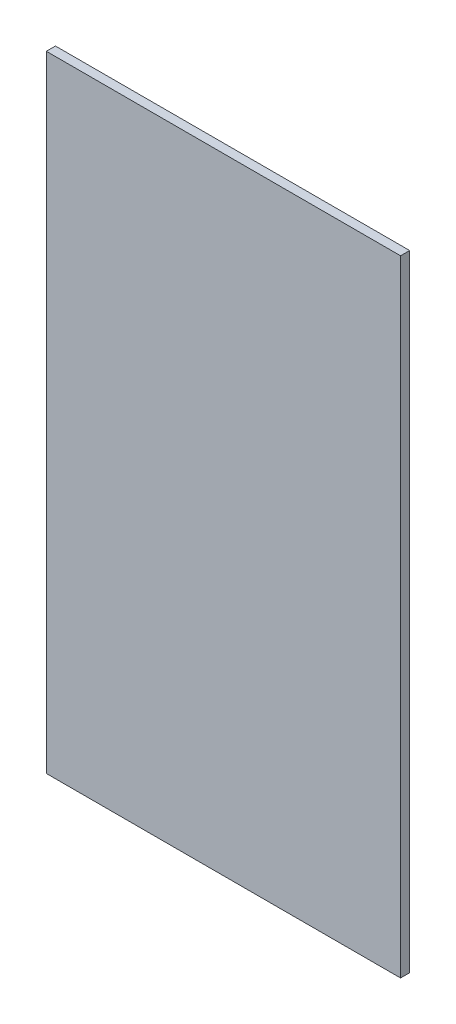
ISO-10303-21;
HEADER;
FILE_DESCRIPTION(('STEP AP214'),'2;1');
FILE_NAME('part.step','',(''),(''),'','','');
FILE_SCHEMA(('AUTOMOTIVE_DESIGN { 1 0 10303 214 1 1 1 1 }'));
ENDSEC;
DATA;
#1=APPLICATION_CONTEXT('core data for automotive mechanical design processes');
#2=APPLICATION_PROTOCOL_DEFINITION('international standard','automotive_design',2000,#1);
#3=PRODUCT_CONTEXT('',#1,'mechanical');
#4=PRODUCT('Part','Part','',(#3));
#5=PRODUCT_RELATED_PRODUCT_CATEGORY('part','',(#4));
#6=PRODUCT_DEFINITION_FORMATION('','',#4);
#7=PRODUCT_DEFINITION_CONTEXT('part definition',#1,'design');
#8=PRODUCT_DEFINITION('design','',#6,#7);
#9=PRODUCT_DEFINITION_SHAPE('','',#8);
#10=(LENGTH_UNIT() NAMED_UNIT(*) SI_UNIT(.MILLI.,.METRE.));
#11=(NAMED_UNIT(*) PLANE_ANGLE_UNIT() SI_UNIT($,.RADIAN.));
#12=(NAMED_UNIT(*) SI_UNIT($,.STERADIAN.) SOLID_ANGLE_UNIT());
#13=UNCERTAINTY_MEASURE_WITH_UNIT(LENGTH_MEASURE(1.E-05),#10,'distance_accuracy_value','');
#14=(GEOMETRIC_REPRESENTATION_CONTEXT(3) GLOBAL_UNCERTAINTY_ASSIGNED_CONTEXT((#13)) GLOBAL_UNIT_ASSIGNED_CONTEXT((#10,
#11,#12)) REPRESENTATION_CONTEXT('',''));
#15=CARTESIAN_POINT('',(0.,0.,0.));
#16=DIRECTION('',(0.,0.,1.));
#17=DIRECTION('',(1.,0.,0.));
#18=AXIS2_PLACEMENT_3D('',#15,#16,#17);
#19=CARTESIAN_POINT('',(350.,618.,18.));
#20=DIRECTION('',(-1.,0.,0.));
#21=DIRECTION('',(0.,-1.,0.));
#22=AXIS2_PLACEMENT_3D('',#19,#20,#21);
#23=PLANE('',#22);
#24=DIRECTION('',(0.,1.,0.));
#25=VECTOR('',#24,1.);
#26=CARTESIAN_POINT('',(350.,618.,0.));
#27=LINE('',#26,#25);
#28=CARTESIAN_POINT('',(350.,-618.,0.));
#29=VERTEX_POINT('',#28);
#30=CARTESIAN_POINT('',(350.,618.,0.));
#31=VERTEX_POINT('',#30);
#32=EDGE_CURVE('E95',#29,#31,#27,.T.);
#33=ORIENTED_EDGE('',*,*,#32,.T.);
#34=DIRECTION('',(0.,0.,-1.));
#35=VECTOR('',#34,1.);
#36=CARTESIAN_POINT('',(350.,618.,18.));
#37=LINE('',#36,#35);
#38=CARTESIAN_POINT('',(350.,618.,18.));
#39=VERTEX_POINT('',#38);
#40=EDGE_CURVE('E11',#39,#31,#37,.T.);
#41=ORIENTED_EDGE('',*,*,#40,.F.);
#42=DIRECTION('',(0.,1.,0.));
#43=VECTOR('',#42,1.);
#44=CARTESIAN_POINT('',(350.,618.,18.));
#45=LINE('',#44,#43);
#46=CARTESIAN_POINT('',(350.,-618.,18.));
#47=VERTEX_POINT('',#46);
#48=EDGE_CURVE('E83',#47,#39,#45,.T.);
#49=ORIENTED_EDGE('',*,*,#48,.F.);
#50=DIRECTION('',(0.,0.,-1.));
#51=VECTOR('',#50,1.);
#52=CARTESIAN_POINT('',(350.,-618.,18.));
#53=LINE('',#52,#51);
#54=EDGE_CURVE('E91',#47,#29,#53,.T.);
#55=ORIENTED_EDGE('',*,*,#54,.T.);
#56=EDGE_LOOP('',(#33,#41,#49,#55));
#57=FACE_BOUND('',#56,.T.);
#58=ADVANCED_FACE('F32',(#57),#23,.F.);
#59=CARTESIAN_POINT('',(-350.,618.,18.));
#60=DIRECTION('',(0.,-1.,0.));
#61=DIRECTION('',(0.,0.,-1.));
#62=AXIS2_PLACEMENT_3D('',#59,#60,#61);
#63=PLANE('',#62);
#64=DIRECTION('',(-1.,0.,0.));
#65=VECTOR('',#64,1.);
#66=CARTESIAN_POINT('',(-350.,618.,0.));
#67=LINE('',#66,#65);
#68=CARTESIAN_POINT('',(-350.,618.,0.));
#69=VERTEX_POINT('',#68);
#70=EDGE_CURVE('E87',#31,#69,#67,.T.);
#71=ORIENTED_EDGE('',*,*,#70,.T.);
#72=DIRECTION('',(0.,0.,-1.));
#73=VECTOR('',#72,1.);
#74=CARTESIAN_POINT('',(-350.,618.,18.));
#75=LINE('',#74,#73);
#76=CARTESIAN_POINT('',(-350.,618.,18.));
#77=VERTEX_POINT('',#76);
#78=EDGE_CURVE('E40',#77,#69,#75,.T.);
#79=ORIENTED_EDGE('',*,*,#78,.F.);
#80=DIRECTION('',(-1.,0.,0.));
#81=VECTOR('',#80,1.);
#82=CARTESIAN_POINT('',(-350.,618.,18.));
#83=LINE('',#82,#81);
#84=EDGE_CURVE('E78',#39,#77,#83,.T.);
#85=ORIENTED_EDGE('',*,*,#84,.F.);
#86=ORIENTED_EDGE('',*,*,#40,.T.);
#87=EDGE_LOOP('',(#71,#79,#85,#86));
#88=FACE_BOUND('',#87,.T.);
#89=ADVANCED_FACE('F86',(#88),#63,.F.);
#90=CARTESIAN_POINT('',(-350.,618.,18.));
#91=DIRECTION('',(1.,0.,0.));
#92=DIRECTION('',(0.,1.,0.));
#93=AXIS2_PLACEMENT_3D('',#90,#91,#92);
#94=PLANE('',#93);
#95=DIRECTION('',(0.,-1.,0.));
#96=VECTOR('',#95,1.);
#97=CARTESIAN_POINT('',(-350.,618.,0.));
#98=LINE('',#97,#96);
#99=CARTESIAN_POINT('',(-350.,-618.,0.));
#100=VERTEX_POINT('',#99);
#101=EDGE_CURVE('E65',#69,#100,#98,.T.);
#102=ORIENTED_EDGE('',*,*,#101,.T.);
#103=DIRECTION('',(0.,0.,-1.));
#104=VECTOR('',#103,1.);
#105=CARTESIAN_POINT('',(-350.,-618.,18.));
#106=LINE('',#105,#104);
#107=CARTESIAN_POINT('',(-350.,-618.,18.));
#108=VERTEX_POINT('',#107);
#109=EDGE_CURVE('E88',#108,#100,#106,.T.);
#110=ORIENTED_EDGE('',*,*,#109,.F.);
#111=DIRECTION('',(0.,-1.,0.));
#112=VECTOR('',#111,1.);
#113=CARTESIAN_POINT('',(-350.,618.,18.));
#114=LINE('',#113,#112);
#115=EDGE_CURVE('E81',#77,#108,#114,.T.);
#116=ORIENTED_EDGE('',*,*,#115,.F.);
#117=ORIENTED_EDGE('',*,*,#78,.T.);
#118=EDGE_LOOP('',(#102,#110,#116,#117));
#119=FACE_BOUND('',#118,.T.);
#120=ADVANCED_FACE('F89',(#119),#94,.F.);
#121=CARTESIAN_POINT('',(-350.,-618.,18.));
#122=DIRECTION('',(0.,1.,0.));
#123=DIRECTION('',(0.,0.,1.));
#124=AXIS2_PLACEMENT_3D('',#121,#122,#123);
#125=PLANE('',#124);
#126=DIRECTION('',(1.,0.,0.));
#127=VECTOR('',#126,1.);
#128=CARTESIAN_POINT('',(-350.,-618.,0.));
#129=LINE('',#128,#127);
#130=EDGE_CURVE('E71',#100,#29,#129,.T.);
#131=ORIENTED_EDGE('',*,*,#130,.T.);
#132=ORIENTED_EDGE('',*,*,#54,.F.);
#133=DIRECTION('',(1.,0.,0.));
#134=VECTOR('',#133,1.);
#135=CARTESIAN_POINT('',(-350.,-618.,18.));
#136=LINE('',#135,#134);
#137=EDGE_CURVE('E48',#108,#47,#136,.T.);
#138=ORIENTED_EDGE('',*,*,#137,.F.);
#139=ORIENTED_EDGE('',*,*,#109,.T.);
#140=EDGE_LOOP('',(#131,#132,#138,#139));
#141=FACE_BOUND('',#140,.T.);
#142=ADVANCED_FACE('F102',(#141),#125,.F.);
#143=CARTESIAN_POINT('',(0.,0.,18.));
#144=DIRECTION('',(0.,0.,1.));
#145=DIRECTION('',(1.,0.,0.));
#146=AXIS2_PLACEMENT_3D('',#143,#144,#145);
#147=PLANE('',#146);
#148=ORIENTED_EDGE('',*,*,#48,.T.);
#149=ORIENTED_EDGE('',*,*,#84,.T.);
#150=ORIENTED_EDGE('',*,*,#115,.T.);
#151=ORIENTED_EDGE('',*,*,#137,.T.);
#152=EDGE_LOOP('',(#148,#149,#150,#151));
#153=FACE_BOUND('',#152,.T.);
#154=ADVANCED_FACE('F79',(#153),#147,.T.);
#155=CARTESIAN_POINT('',(0.,0.,0.));
#156=DIRECTION('',(0.,0.,1.));
#157=DIRECTION('',(1.,0.,0.));
#158=AXIS2_PLACEMENT_3D('',#155,#156,#157);
#159=PLANE('',#158);
#160=ORIENTED_EDGE('',*,*,#32,.F.);
#161=ORIENTED_EDGE('',*,*,#130,.F.);
#162=ORIENTED_EDGE('',*,*,#101,.F.);
#163=ORIENTED_EDGE('',*,*,#70,.F.);
#164=EDGE_LOOP('',(#160,#161,#162,#163));
#165=FACE_BOUND('',#164,.T.);
#166=ADVANCED_FACE('F105',(#165),#159,.F.);
#167=CLOSED_SHELL('',(#58,#89,#120,#142,#154,#166));
#168=MANIFOLD_SOLID_BREP('B2',#167);
#169=ADVANCED_BREP_SHAPE_REPRESENTATION('',(#18,#168),#14);
#170=SHAPE_DEFINITION_REPRESENTATION(#9,#169);
ENDSEC;
END-ISO-10303-21;
